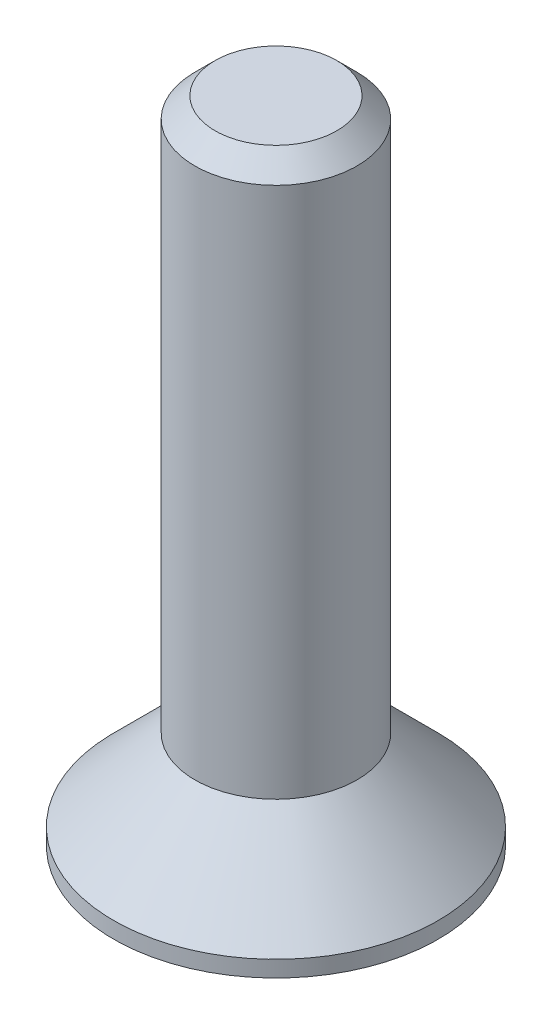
from build123d import *

# Parameters (mm, degrees)
CHANFREIN1_SIZE         = 0.5
ENL_V_MAT_EXTRU_1_DEPTH = 2


with BuildPart() as part:
    # Esquisse1 → R_volution1 (revolve)
    with BuildSketch(Plane.XY, mode=Mode.PRIVATE) as r_volution1_sk:
        Polygon((0, 0), (-4, 0), (-4, 0.4), (-2, 2.4), (-2, 16), (0, 16), align=None)
    revolve(r_volution1_sk.sketch.rotate(Axis((0, 0, 0), (0, 1, 0)), 270), axis=Axis((0, 0, 0), (0, 1, 0)))

    # Chanfrein1
    chanfrein1_edges = [part.edges().sort_by_distance(p)[0] for p in [
        (0, 16, 2),
    ]]
    chamfer(chanfrein1_edges, length=CHANFREIN1_SIZE)

    # Esquisse3 → Enl_v. mat.-Extru.1 (cut)
    with BuildSketch(Plane.XZ):
        Polygon((1.25, 0.721687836), (0, 1.443375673), (-1.25, 0.721687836), (-1.25, -0.721687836), (0, -1.443375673), (1.25, -0.721687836), align=None)
    extrude(amount=-ENL_V_MAT_EXTRU_1_DEPTH, mode=Mode.SUBTRACT)


solid = part.part
